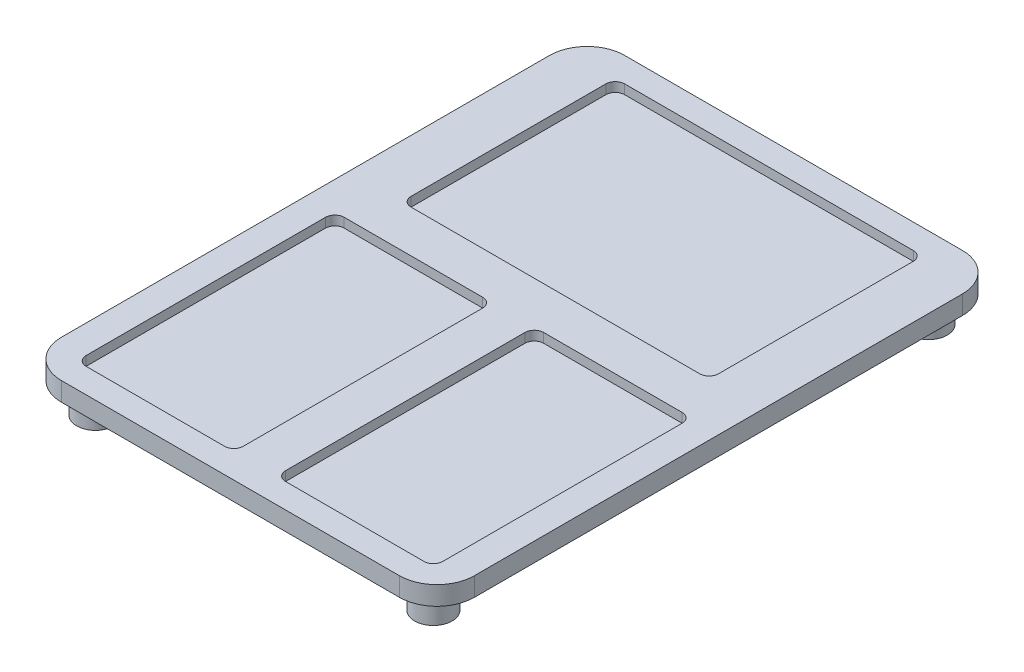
from build123d import *

# Parameters (mm, degrees)
BOSS_EXTRUDE1_DEPTH = 25.4
CUT_EXTRUDE1_DEPTH  = 12.7
SKETCH3_R           = 25.4
BOSS_EXTRUDE2_DEPTH = 38.1


with BuildPart() as part:
    # Sketch1 → Boss-Extrude1 (new body)
    with BuildSketch(Plane(origin=(0, 0, 0), x_dir=(1, 0, 0), z_dir=(0, 1, 0))):
        with BuildLine():
            Line((228.6, -381), (-228.6, -381))
            ThreePointArc((-228.6, -381), (-264.521024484, -366.121024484), (-279.4, -330.2))
            Line((-279.4, -330.2), (-279.4, 330.2))
            ThreePointArc((-279.4, 330.2), (-264.521024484, 366.121024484), (-228.6, 381))
            Line((-228.6, 381), (228.6, 381))
            ThreePointArc((228.6, 381), (264.521024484, 366.121024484), (279.4, 330.2))
            Line((279.4, 330.2), (279.4, -330.2))
            ThreePointArc((279.4, -330.2), (264.521024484, -366.121024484), (228.6, -381))
        make_face()
    extrude(amount=BOSS_EXTRUDE1_DEPTH)

    # Sketch2 → Cut-Extrude1 (cut)
    with BuildSketch(Plane(origin=(0, 25.4, 0), x_dir=(1, 0, 0), z_dir=(0, 1, 0))):
        with BuildLine():
            Line((-228.6, 1.5875), (-41.275, 1.5875))
            ThreePointArc((-41.275, 1.5875), (-32.294743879, -2.132243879), (-28.575, -11.1125))
            Line((-28.575, -11.1125), (-28.575, -334.9625))
            ThreePointArc((-28.575, -334.9625), (-32.294743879, -343.942756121), (-41.275, -347.6625))
            Line((-41.275, -347.6625), (-228.6, -347.6625))
            ThreePointArc((-228.6, -347.6625), (-237.580256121, -343.942756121), (-241.3, -334.9625))
            Line((-241.3, -334.9625), (-241.3, -11.1125))
            ThreePointArc((-241.3, -11.1125), (-237.580256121, -2.132243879), (-228.6, 1.5875))
        make_face()
        with BuildLine():
            Line((41.275, 1.5875), (228.6, 1.5875))
            ThreePointArc((228.6, 1.5875), (237.580256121, -2.132243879), (241.3, -11.1125))
            Line((241.3, -11.1125), (241.3, -334.9625))
            ThreePointArc((241.3, -334.9625), (237.580256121, -343.942756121), (228.6, -347.6625))
            Line((228.6, -347.6625), (41.275, -347.6625))
            ThreePointArc((41.275, -347.6625), (32.294743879, -343.942756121), (28.575, -334.9625))
            Line((28.575, -334.9625), (28.575, -11.1125))
            ThreePointArc((28.575, -11.1125), (32.294743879, -2.132243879), (41.275, 1.5875))
        make_face()
        with BuildLine():
            Line((-195.2625, 58.7375), (195.2625, 58.7375))
            ThreePointArc((195.2625, 58.7375), (204.242756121, 62.457243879), (207.9625, 71.4375))
            Line((207.9625, 71.4375), (207.9625, 334.9625))
            ThreePointArc((207.9625, 334.9625), (204.242756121, 343.942756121), (195.2625, 347.6625))
            Line((195.2625, 347.6625), (-195.2625, 347.6625))
            ThreePointArc((-195.2625, 347.6625), (-204.242756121, 343.942756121), (-207.9625, 334.9625))
            Line((-207.9625, 334.9625), (-207.9625, 71.4375))
            ThreePointArc((-207.9625, 71.4375), (-204.242756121, 62.457243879), (-195.2625, 58.7375))
        make_face()
    extrude(amount=-CUT_EXTRUDE1_DEPTH, mode=Mode.SUBTRACT)

    # Sketch3 → Boss-Extrude2 (add)
    with BuildSketch(Plane.XZ):
        with Locations(Location((-228.6, 334.9625, 0), (0, 0, 90))):
            Circle(SKETCH3_R)
        with Locations(Location((-228.6, -334.9625, 0), (0, 0, 90))):
            Circle(SKETCH3_R)
        with Locations(Location((228.6, -334.9625, 0), (0, 0, 90))):
            Circle(SKETCH3_R)
        with Locations(Location((228.6, 334.9625, 0), (0, 0, 90))):
            Circle(SKETCH3_R)
    extrude(amount=BOSS_EXTRUDE2_DEPTH)


solid = part.part
